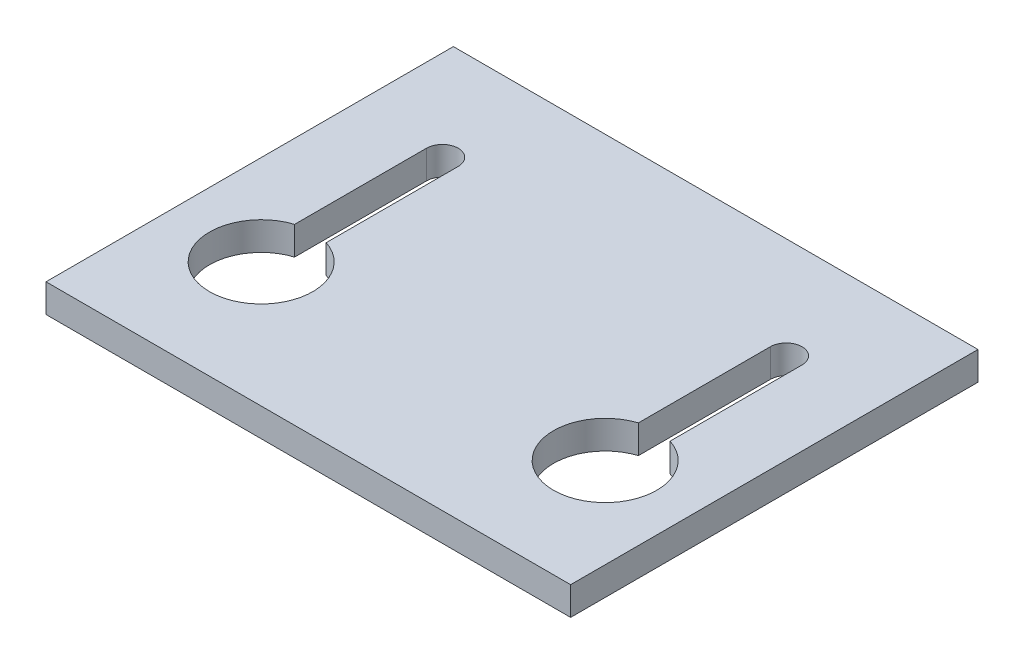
from build123d import *

# Parameters (mm, degrees)
SKETCH1_W          = 140.940304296
SKETCH1_H          = 109.439882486
EXTRUDE1_DEPTH     = 7.62
CUT_EXTRUDE1_DEPTH = 179.603811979


with BuildPart() as part:
    # Sketch1 → Extrude1 (new body)
    with BuildSketch(Plane(origin=(0, 0, 0), x_dir=(1, 0, 0), z_dir=(0, 1, 0))):
        with Locations((70.470152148, -54.719941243)):
            Rectangle(SKETCH1_W, SKETCH1_H)
    extrude(amount=EXTRUDE1_DEPTH)

    # Sketch2 → Cut-Extrude1 (cut, through all)
    with BuildSketch(Plane(origin=(0, 7.62, 0), x_dir=(-1, 0, 0), z_dir=(0, 1, 0))):
        with BuildLine():
            Line((-28.538162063, 27.248067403), (-28.538162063, 62.703226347))
            ThreePointArc((-28.538162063, 62.703226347), (-24.236325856, 89.778457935), (-20.030491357, 62.688147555))
            Line((-20.030491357, 62.688147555), (-20.030491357, 27.248067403))
            ThreePointArc((-20.030491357, 27.248067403), (-24.28432671, 22.99423205), (-28.538162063, 27.248067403))
        make_face()
    cut_extrude1 = extrude(amount=-CUT_EXTRUDE1_DEPTH, mode=Mode.SUBTRACT)

    # Mirror1: Cut-Extrude1 across plane
    add(cut_extrude1.mirror(Plane(origin=(70.470152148, 0, 0), x_dir=(0, 0, 1), z_dir=(1, 0, 0))), mode=Mode.SUBTRACT)


solid = part.part
